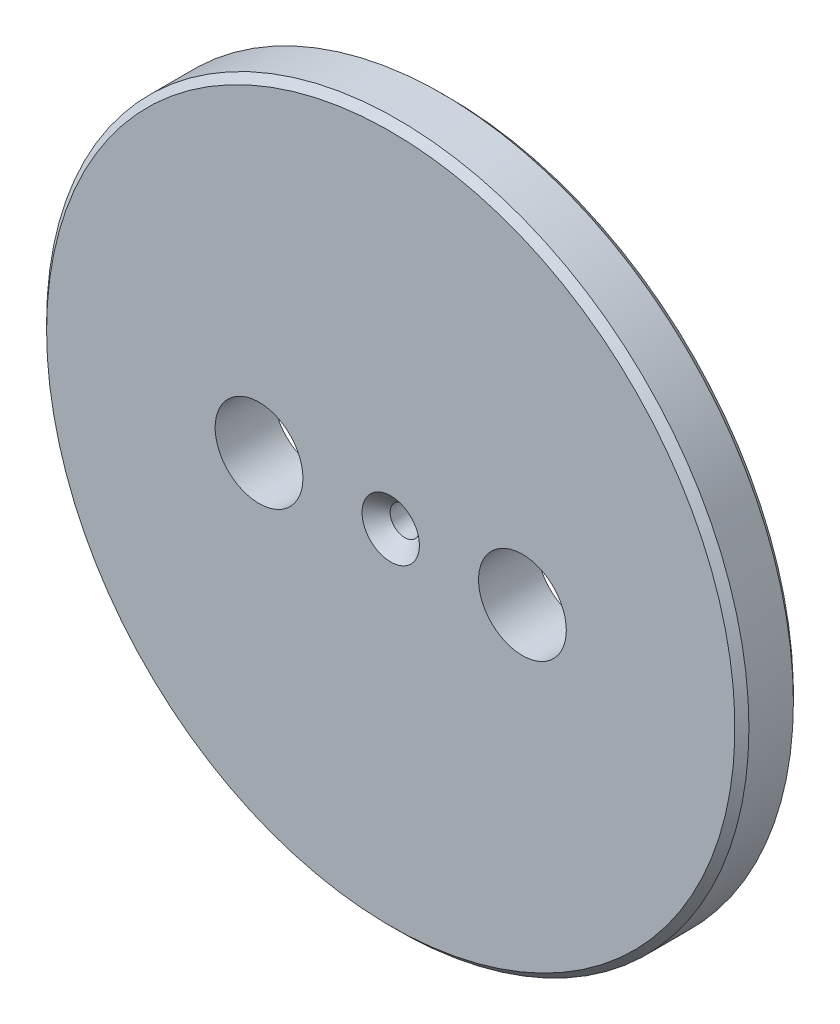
from build123d import *

# Parameters (mm, degrees)
SKETCH1_R                    = 38.1
SKETCH1_R_2                  = 1.5875
BASE_EXTRUDE_DEPTH           = 4.7625
BOSS_EXTRUDE1_START          = 1.5875
SKETCH2_R                    = 38.1
SKETCH2_R_2                  = 4.7625
BOSS_EXTRUDE1_DEPTH          = 1.5875
SCREW_HOLE_C_SINK_SIZE       = 1.524
PERIMETER_SIZE               = 0.762
SKETCH3_R                    = 4.7625
WRENCH_CLEARANCE_HOLES_DEPTH = 55.254423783


with BuildPart() as part:
    # Sketch1 → Base-Extrude (new body)
    with BuildSketch(Plane.XY):
        with Locations(Location((0, 0, 0), (0, 0, 180))):
            Circle(SKETCH1_R)
        with Locations(Location((0, 0, 0), (0, 0, 180))):
            Circle(SKETCH1_R_2, mode=Mode.SUBTRACT)
    extrude(amount=BASE_EXTRUDE_DEPTH)

    # Sketch2 → Boss-Extrude1 (add)
    with BuildSketch(Plane(origin=(0, 0, 0), x_dir=(-1, 0, 0), z_dir=(0, 0, -1)).offset(BOSS_EXTRUDE1_START)):
        Circle(SKETCH2_R)
        with Locations(Location((0, 0, 0), (0, 0, 180))):
            Circle(SKETCH2_R_2, mode=Mode.SUBTRACT)
    extrude(amount=-BOSS_EXTRUDE1_DEPTH)

    # screw hole c sink
    screw_hole_c_sink_edges = [part.edges().sort_by_distance(p)[0] for p in [
        (1.5875, 0, 4.7625),
    ]]
    chamfer(screw_hole_c_sink_edges, length=SCREW_HOLE_C_SINK_SIZE)

    # perimeter
    perimeter_edges = [part.edges().sort_by_distance(p)[0] for p in [
        (38.1, 0, 4.7625),
        (38.1, 0, -1.5875),
    ]]
    chamfer(perimeter_edges, length=PERIMETER_SIZE)

    # Sketch3 → wrench clearance holes (cut, through all)
    with BuildSketch(Plane.XY.offset(4.7625)):
        with Locations((-14.2875, 0)):
            Circle(SKETCH3_R)
        with Locations((14.2875, 0)):
            Circle(SKETCH3_R)
    extrude(amount=-WRENCH_CLEARANCE_HOLES_DEPTH, mode=Mode.SUBTRACT)


solid = part.part
